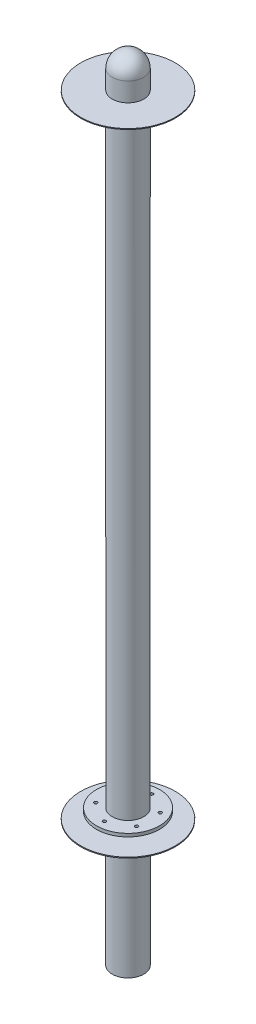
from build123d import *

# Parameters (mm, degrees)
SKETCH1_R           = 50
BOSS_EXTRUDE1_DEPTH = 2000
SKETCH2_R           = 150
BOSS_EXTRUDE2_DEPTH = 3
BOSS_EXTRUDE3_START = 400
SKETCH3_R           = 50
BOSS_EXTRUDE3_DEPTH = 400
BOSS_EXTRUDE4_START = 2.72903008
SKETCH4_R           = 150
BOSS_EXTRUDE4_DEPTH = 2.72903008
SKETCH5_R           = 50
BOSS_EXTRUDE5_DEPTH = 60
DOME1_FACE_RADIUS   = 50
DOME1_HEIGHT        = 50
SKETCH6_R           = 100
SKETCH6_R_2         = 5
BOSS_EXTRUDE6_DEPTH = 10
BOSS_EXTRUDE7_START = 10
SKETCH7_R           = 100
SKETCH7_R_2         = 5
BOSS_EXTRUDE7_DEPTH = 10


with BuildPart() as part:
    # Sketch1 → Boss-Extrude1 (new body)
    with BuildSketch(Plane(origin=(0, 0, 0), x_dir=(1, 0, 0), z_dir=(0, 1, 0))):
        with Locations(Location((0, 0, 0), (0, 0, 270))):
            Circle(SKETCH1_R)
    extrude(amount=BOSS_EXTRUDE1_DEPTH)

    # Sketch2 → Boss-Extrude2 (add)
    with BuildSketch(Plane.XZ):
        with Locations(Location((0, 0, 0), (0, 0, 270))):
            Circle(SKETCH2_R)
    extrude(amount=BOSS_EXTRUDE2_DEPTH)

    # Sketch3 → Boss-Extrude3 (add)
    with BuildSketch(Plane.XZ.offset(3).offset(BOSS_EXTRUDE3_START)):
        with Locations(Location((0, 0, 0), (0, 0, 270))):
            Circle(SKETCH3_R)
    extrude(amount=-BOSS_EXTRUDE3_DEPTH)

    # Sketch4 → Boss-Extrude4 (add)
    with BuildSketch(Plane(origin=(0, 2000, 0), x_dir=(1, 0, 0), z_dir=(0, 1, 0)).offset(BOSS_EXTRUDE4_START)):
        with Locations(Location((0, 0, 0), (0, 0, 90))):
            Circle(SKETCH4_R)
    extrude(amount=-BOSS_EXTRUDE4_DEPTH)

    # Sketch5 → Boss-Extrude5 (add)
    with BuildSketch(Plane(origin=(0, 2002.72903008, 0), x_dir=(1, 0, 0), z_dir=(0, 1, 0))):
        with Locations(Location((0, 0, 0), (0, 0, 90))):
            Circle(SKETCH5_R)
    extrude(amount=BOSS_EXTRUDE5_DEPTH)

    # Dome1: a dome of height H over a round flat face of radius A is a cap of a sphere of radius (A * A + H * H) / (2 * H)
    dome1_r = (DOME1_FACE_RADIUS * DOME1_FACE_RADIUS + DOME1_HEIGHT * DOME1_HEIGHT) / (2 * DOME1_HEIGHT)
    dome1_base = Plane((0, 2062.72903008, 0), z_dir=(0, 1, 0))
    with Locations(dome1_base.offset(DOME1_HEIGHT - dome1_r)):
        dome1_ball = Sphere(dome1_r, mode=Mode.PRIVATE)
    add(split(dome1_ball, bisect_by=dome1_base, keep=Keep.TOP, mode=Mode.PRIVATE))

    # Sketch6 → Boss-Extrude6 (add)
    with BuildSketch(Plane(origin=(0, 20, 0), x_dir=(1, 0, 0), z_dir=(0, 1, 0))):
        with Locations(Location((0, 0, 0), (0, 0, 270))):
            Circle(SKETCH6_R)
        with Locations(Location((0, 75, 0), (0, 0, 270))):
            Circle(SKETCH6_R_2, mode=Mode.SUBTRACT)
        with Locations(Location((64.951905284, 37.5, 0), (0, 0, 270))):
            Circle(SKETCH6_R_2, mode=Mode.SUBTRACT)
        with Locations(Location((64.951905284, -37.5, 0), (0, 0, 270))):
            Circle(SKETCH6_R_2, mode=Mode.SUBTRACT)
        with Locations(Location((0, -75, 0), (0, 0, 270))):
            Circle(SKETCH6_R_2, mode=Mode.SUBTRACT)
        with Locations(Location((-64.951905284, -37.5, 0), (0, 0, 270))):
            Circle(SKETCH6_R_2, mode=Mode.SUBTRACT)
        with Locations(Location((-64.951905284, 37.5, 0), (0, 0, 270))):
            Circle(SKETCH6_R_2, mode=Mode.SUBTRACT)
    extrude(amount=BOSS_EXTRUDE6_DEPTH)

    # Sketch7 → Boss-Extrude7 (add)
    with BuildSketch(Plane(origin=(0, 1990, 0), x_dir=(-1, 0, 0), z_dir=(0, -1, 0)).offset(BOSS_EXTRUDE7_START)):
        with Locations(Location((0, 0, 0), (0, 0, 270))):
            Circle(SKETCH7_R)
        with Locations(Location((-64.951905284, -37.5, 0), (0, 0, 270))):
            Circle(SKETCH7_R_2, mode=Mode.SUBTRACT)
        with Locations(Location((-64.951905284, 37.5, 0), (0, 0, 270))):
            Circle(SKETCH7_R_2, mode=Mode.SUBTRACT)
        with Locations(Location((0, 75, 0), (0, 0, 270))):
            Circle(SKETCH7_R_2, mode=Mode.SUBTRACT)
        with Locations(Location((64.951905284, 37.5, 0), (0, 0, 270))):
            Circle(SKETCH7_R_2, mode=Mode.SUBTRACT)
        with Locations(Location((64.951905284, -37.5, 0), (0, 0, 270))):
            Circle(SKETCH7_R_2, mode=Mode.SUBTRACT)
        with Locations(Location((0, -75, 0), (0, 0, 270))):
            Circle(SKETCH7_R_2, mode=Mode.SUBTRACT)
    extrude(amount=-BOSS_EXTRUDE7_DEPTH)


solid = part.part
